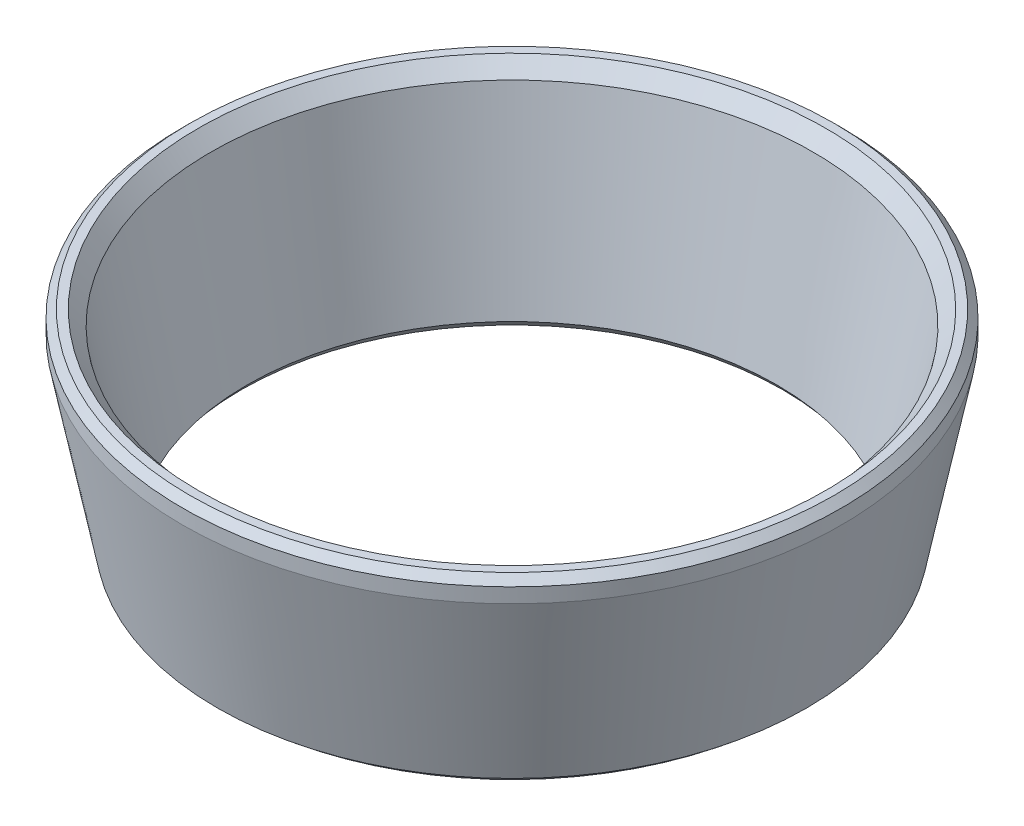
from build123d import *

# Parameters (mm, degrees)
CHAMFER1_SIZE  = 1
CHAMFER1_SIZE2 = 0.664425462
CHAMFER2_SIZE  = 0.5


with BuildPart() as part:
    # Sketch2 → Revolve1 (revolve)
    with BuildSketch(Plane.XY, mode=Mode.PRIVATE) as revolve1_sk:
        Polygon((20.757977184, 14), (22.5, 14), (22.5, 12.5), (20.027200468, 0), (17.988441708, 0), align=None)
    revolve(revolve1_sk.sketch.rotate(Axis((0, 0, 0), (0, 1, 0)), 90), axis=Axis((0, 0, 0), (0, 1, 0)))

    # Chamfer1
    chamfer1_edges = [part.edges().sort_by_distance(p)[0] for p in [
        (0, 14, 20.757977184),
    ]]
    chamfer1_side = [part.faces().sort_by_distance(p)[0] for p in [
        (0, 7, 19.373209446),
    ]]
    chamfer(chamfer1_edges, length=CHAMFER1_SIZE, length2=CHAMFER1_SIZE2, reference=chamfer1_side[0])

    # Chamfer2
    chamfer2_edges = [part.edges().sort_by_distance(p)[0] for p in [
        (0, 0, 17.988441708),
        (0, 0, 20.027200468),
        (0, 14, 22.5),
    ]]
    chamfer(chamfer2_edges, length=CHAMFER2_SIZE)


solid = part.part
